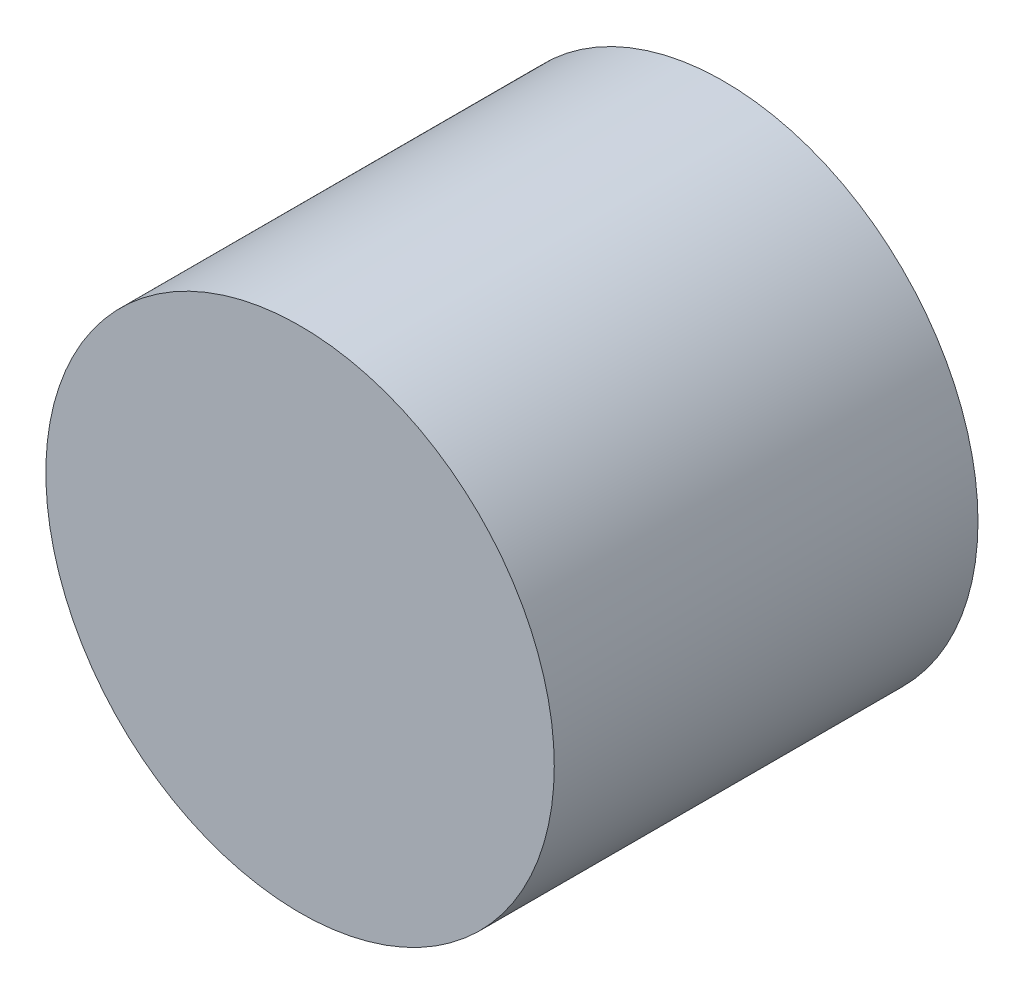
ISO-10303-21;
HEADER;
FILE_DESCRIPTION(('STEP AP214'),'2;1');
FILE_NAME('part.step','',(''),(''),'','','');
FILE_SCHEMA(('AUTOMOTIVE_DESIGN { 1 0 10303 214 1 1 1 1 }'));
ENDSEC;
DATA;
#1=APPLICATION_CONTEXT('core data for automotive mechanical design processes');
#2=APPLICATION_PROTOCOL_DEFINITION('international standard','automotive_design',2000,#1);
#3=PRODUCT_CONTEXT('',#1,'mechanical');
#4=PRODUCT('Part','Part','',(#3));
#5=PRODUCT_RELATED_PRODUCT_CATEGORY('part','',(#4));
#6=PRODUCT_DEFINITION_FORMATION('','',#4);
#7=PRODUCT_DEFINITION_CONTEXT('part definition',#1,'design');
#8=PRODUCT_DEFINITION('design','',#6,#7);
#9=PRODUCT_DEFINITION_SHAPE('','',#8);
#10=(LENGTH_UNIT() NAMED_UNIT(*) SI_UNIT(.MILLI.,.METRE.));
#11=(NAMED_UNIT(*) PLANE_ANGLE_UNIT() SI_UNIT($,.RADIAN.));
#12=(NAMED_UNIT(*) SI_UNIT($,.STERADIAN.) SOLID_ANGLE_UNIT());
#13=UNCERTAINTY_MEASURE_WITH_UNIT(LENGTH_MEASURE(1.E-05),#10,'distance_accuracy_value','');
#14=(GEOMETRIC_REPRESENTATION_CONTEXT(3) GLOBAL_UNCERTAINTY_ASSIGNED_CONTEXT((#13)) GLOBAL_UNIT_ASSIGNED_CONTEXT((#10,
#11,#12)) REPRESENTATION_CONTEXT('',''));
#15=CARTESIAN_POINT('',(0.,0.,0.));
#16=DIRECTION('',(0.,0.,1.));
#17=DIRECTION('',(1.,0.,0.));
#18=AXIS2_PLACEMENT_3D('',#15,#16,#17);
#19=CARTESIAN_POINT('',(0.,0.,100.));
#20=DIRECTION('',(0.,0.,-1.));
#21=DIRECTION('',(-1.,0.,0.));
#22=AXIS2_PLACEMENT_3D('',#19,#20,#21);
#23=CYLINDRICAL_SURFACE('',#22,60.);
#24=CARTESIAN_POINT('',(0.,0.,100.));
#25=DIRECTION('',(0.,0.,1.));
#26=DIRECTION('',(1.,0.,0.));
#27=AXIS2_PLACEMENT_3D('',#24,#25,#26);
#28=CIRCLE('',#27,60.);
#29=CARTESIAN_POINT('',(60.,0.,100.));
#30=VERTEX_POINT('',#29);
#31=EDGE_CURVE('E10',#30,#30,#28,.T.);
#32=ORIENTED_EDGE('',*,*,#31,.F.);
#33=EDGE_LOOP('',(#32));
#34=FACE_BOUND('',#33,.T.);
#35=CARTESIAN_POINT('',(0.,0.,0.));
#36=DIRECTION('',(0.,0.,1.));
#37=DIRECTION('',(1.,0.,0.));
#38=AXIS2_PLACEMENT_3D('',#35,#36,#37);
#39=CIRCLE('',#38,60.);
#40=CARTESIAN_POINT('',(60.,0.,0.));
#41=VERTEX_POINT('',#40);
#42=EDGE_CURVE('E34',#41,#41,#39,.T.);
#43=ORIENTED_EDGE('',*,*,#42,.T.);
#44=EDGE_LOOP('',(#43));
#45=FACE_BOUND('',#44,.T.);
#46=ADVANCED_FACE('F31',(#34,#45),#23,.T.);
#47=CARTESIAN_POINT('',(0.,0.,100.));
#48=DIRECTION('',(0.,0.,1.));
#49=DIRECTION('',(1.,0.,0.));
#50=AXIS2_PLACEMENT_3D('',#47,#48,#49);
#51=PLANE('',#50);
#52=ORIENTED_EDGE('',*,*,#31,.T.);
#53=EDGE_LOOP('',(#52));
#54=FACE_BOUND('',#53,.T.);
#55=ADVANCED_FACE('F46',(#54),#51,.T.);
#56=CARTESIAN_POINT('',(0.,0.,0.));
#57=DIRECTION('',(0.,0.,1.));
#58=DIRECTION('',(1.,0.,0.));
#59=AXIS2_PLACEMENT_3D('',#56,#57,#58);
#60=PLANE('',#59);
#61=ORIENTED_EDGE('',*,*,#42,.F.);
#62=EDGE_LOOP('',(#61));
#63=FACE_BOUND('',#62,.T.);
#64=ADVANCED_FACE('F44',(#63),#60,.F.);
#65=CLOSED_SHELL('',(#46,#55,#64));
#66=MANIFOLD_SOLID_BREP('B2',#65);
#67=ADVANCED_BREP_SHAPE_REPRESENTATION('',(#18,#66),#14);
#68=SHAPE_DEFINITION_REPRESENTATION(#9,#67);
ENDSEC;
END-ISO-10303-21;
